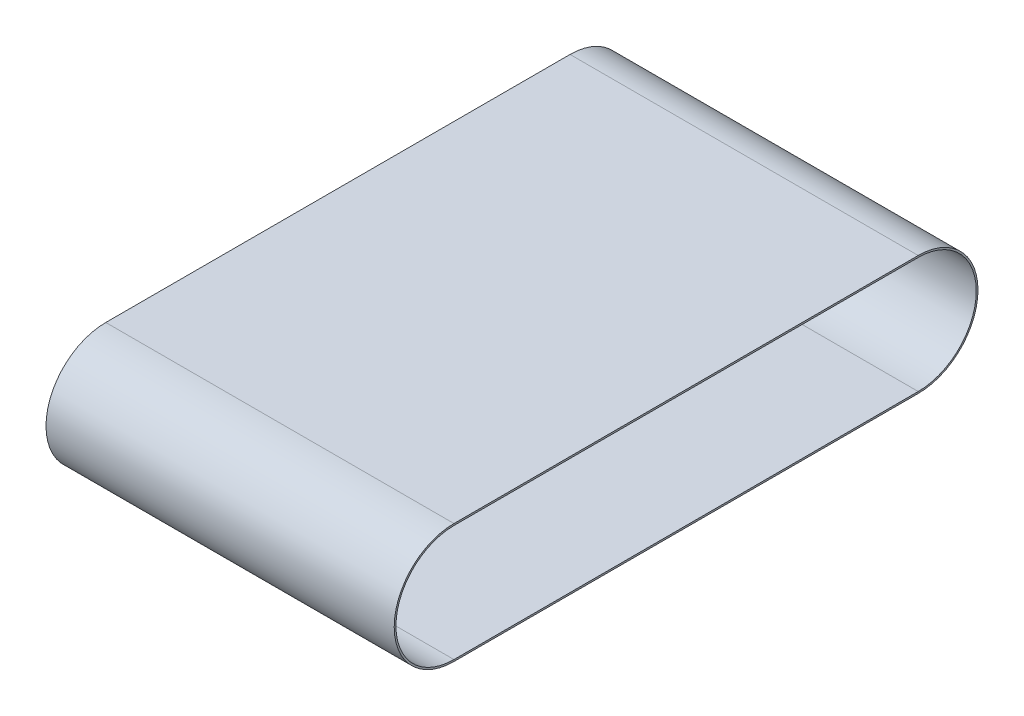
ISO-10303-21;
HEADER;
FILE_DESCRIPTION(('STEP AP214'),'2;1');
FILE_NAME('part.step','',(''),(''),'','','');
FILE_SCHEMA(('AUTOMOTIVE_DESIGN { 1 0 10303 214 1 1 1 1 }'));
ENDSEC;
DATA;
#1=APPLICATION_CONTEXT('core data for automotive mechanical design processes');
#2=APPLICATION_PROTOCOL_DEFINITION('international standard','automotive_design',2000,#1);
#3=PRODUCT_CONTEXT('',#1,'mechanical');
#4=PRODUCT('Part','Part','',(#3));
#5=PRODUCT_RELATED_PRODUCT_CATEGORY('part','',(#4));
#6=PRODUCT_DEFINITION_FORMATION('','',#4);
#7=PRODUCT_DEFINITION_CONTEXT('part definition',#1,'design');
#8=PRODUCT_DEFINITION('design','',#6,#7);
#9=PRODUCT_DEFINITION_SHAPE('','',#8);
#10=(LENGTH_UNIT() NAMED_UNIT(*) SI_UNIT(.MILLI.,.METRE.));
#11=(NAMED_UNIT(*) PLANE_ANGLE_UNIT() SI_UNIT($,.RADIAN.));
#12=(NAMED_UNIT(*) SI_UNIT($,.STERADIAN.) SOLID_ANGLE_UNIT());
#13=UNCERTAINTY_MEASURE_WITH_UNIT(LENGTH_MEASURE(1.E-05),#10,'distance_accuracy_value','');
#14=(GEOMETRIC_REPRESENTATION_CONTEXT(3) GLOBAL_UNCERTAINTY_ASSIGNED_CONTEXT((#13)) GLOBAL_UNIT_ASSIGNED_CONTEXT((#10,
#11,#12)) REPRESENTATION_CONTEXT('',''));
#15=CARTESIAN_POINT('',(0.,0.,0.));
#16=DIRECTION('',(0.,0.,1.));
#17=DIRECTION('',(1.,0.,0.));
#18=AXIS2_PLACEMENT_3D('',#15,#16,#17);
#19=CARTESIAN_POINT('',(300.,0.,0.));
#20=DIRECTION('',(1.,0.,0.));
#21=DIRECTION('',(0.,0.,-1.));
#22=AXIS2_PLACEMENT_3D('',#19,#20,#21);
#23=PLANE('',#22);
#24=CARTESIAN_POINT('',(300.,0.,0.));
#25=DIRECTION('',(1.,0.,0.));
#26=DIRECTION('',(0.,0.,-1.));
#27=AXIS2_PLACEMENT_3D('',#24,#25,#26);
#28=CIRCLE('',#27,103.);
#29=CARTESIAN_POINT('',(300.,103.,0.));
#30=VERTEX_POINT('',#29);
#31=CARTESIAN_POINT('',(300.,-103.,0.));
#32=VERTEX_POINT('',#31);
#33=EDGE_CURVE('E139',#30,#32,#28,.T.);
#34=ORIENTED_EDGE('',*,*,#33,.T.);
#35=DIRECTION('',(0.,0.,-1.));
#36=VECTOR('',#35,1.);
#37=CARTESIAN_POINT('',(300.,-103.,0.));
#38=LINE('',#37,#36);
#39=CARTESIAN_POINT('',(300.,-103.,-800.));
#40=VERTEX_POINT('',#39);
#41=EDGE_CURVE('E142',#32,#40,#38,.T.);
#42=ORIENTED_EDGE('',*,*,#41,.T.);
#43=CARTESIAN_POINT('',(300.,0.,-800.));
#44=DIRECTION('',(1.,0.,0.));
#45=DIRECTION('',(0.,0.,-1.));
#46=AXIS2_PLACEMENT_3D('',#43,#44,#45);
#47=CIRCLE('',#46,103.);
#48=CARTESIAN_POINT('',(300.,103.,-800.));
#49=VERTEX_POINT('',#48);
#50=EDGE_CURVE('E145',#40,#49,#47,.T.);
#51=ORIENTED_EDGE('',*,*,#50,.T.);
#52=DIRECTION('',(0.,0.,1.));
#53=VECTOR('',#52,1.);
#54=CARTESIAN_POINT('',(300.,103.,0.));
#55=LINE('',#54,#53);
#56=EDGE_CURVE('E147',#49,#30,#55,.T.);
#57=ORIENTED_EDGE('',*,*,#56,.T.);
#58=EDGE_LOOP('',(#34,#42,#51,#57));
#59=FACE_BOUND('',#58,.T.);
#60=DIRECTION('',(0.,0.,-1.));
#61=VECTOR('',#60,1.);
#62=CARTESIAN_POINT('',(300.,-100.,0.));
#63=LINE('',#62,#61);
#64=CARTESIAN_POINT('',(300.,-100.,0.));
#65=VERTEX_POINT('',#64);
#66=CARTESIAN_POINT('',(300.,-100.,-800.));
#67=VERTEX_POINT('',#66);
#68=EDGE_CURVE('E111',#65,#67,#63,.T.);
#69=ORIENTED_EDGE('',*,*,#68,.F.);
#70=CARTESIAN_POINT('',(300.,0.,0.));
#71=DIRECTION('',(1.,0.,0.));
#72=DIRECTION('',(0.,0.,-1.));
#73=AXIS2_PLACEMENT_3D('',#70,#71,#72);
#74=CIRCLE('',#73,100.);
#75=CARTESIAN_POINT('',(300.,100.,0.));
#76=VERTEX_POINT('',#75);
#77=EDGE_CURVE('E103',#76,#65,#74,.T.);
#78=ORIENTED_EDGE('',*,*,#77,.F.);
#79=DIRECTION('',(0.,0.,1.));
#80=VECTOR('',#79,1.);
#81=CARTESIAN_POINT('',(300.,100.,0.));
#82=LINE('',#81,#80);
#83=CARTESIAN_POINT('',(300.,100.,-800.));
#84=VERTEX_POINT('',#83);
#85=EDGE_CURVE('E125',#84,#76,#82,.T.);
#86=ORIENTED_EDGE('',*,*,#85,.F.);
#87=CARTESIAN_POINT('',(300.,0.,-800.));
#88=DIRECTION('',(1.,0.,0.));
#89=DIRECTION('',(0.,0.,-1.));
#90=AXIS2_PLACEMENT_3D('',#87,#88,#89);
#91=CIRCLE('',#90,100.);
#92=EDGE_CURVE('E123',#67,#84,#91,.T.);
#93=ORIENTED_EDGE('',*,*,#92,.F.);
#94=EDGE_LOOP('',(#69,#78,#86,#93));
#95=FACE_BOUND('',#94,.T.);
#96=ADVANCED_FACE('F38',(#59,#95),#23,.T.);
#97=CARTESIAN_POINT('',(-300.,0.,0.));
#98=DIRECTION('',(1.,0.,0.));
#99=DIRECTION('',(0.,0.,-1.));
#100=AXIS2_PLACEMENT_3D('',#97,#98,#99);
#101=PLANE('',#100);
#102=CARTESIAN_POINT('',(-300.,0.,0.));
#103=DIRECTION('',(1.,0.,0.));
#104=DIRECTION('',(0.,0.,-1.));
#105=AXIS2_PLACEMENT_3D('',#102,#103,#104);
#106=CIRCLE('',#105,103.);
#107=CARTESIAN_POINT('',(-300.,103.,0.));
#108=VERTEX_POINT('',#107);
#109=CARTESIAN_POINT('',(-300.,-103.,0.));
#110=VERTEX_POINT('',#109);
#111=EDGE_CURVE('E119',#108,#110,#106,.T.);
#112=ORIENTED_EDGE('',*,*,#111,.F.);
#113=DIRECTION('',(0.,0.,1.));
#114=VECTOR('',#113,1.);
#115=CARTESIAN_POINT('',(-300.,103.,0.));
#116=LINE('',#115,#114);
#117=CARTESIAN_POINT('',(-300.,103.,-800.));
#118=VERTEX_POINT('',#117);
#119=EDGE_CURVE('E143',#118,#108,#116,.T.);
#120=ORIENTED_EDGE('',*,*,#119,.F.);
#121=CARTESIAN_POINT('',(-300.,0.,-800.));
#122=DIRECTION('',(1.,0.,0.));
#123=DIRECTION('',(0.,0.,-1.));
#124=AXIS2_PLACEMENT_3D('',#121,#122,#123);
#125=CIRCLE('',#124,103.);
#126=CARTESIAN_POINT('',(-300.,-103.,-800.));
#127=VERTEX_POINT('',#126);
#128=EDGE_CURVE('E154',#127,#118,#125,.T.);
#129=ORIENTED_EDGE('',*,*,#128,.F.);
#130=DIRECTION('',(0.,0.,-1.));
#131=VECTOR('',#130,1.);
#132=CARTESIAN_POINT('',(-300.,-103.,0.));
#133=LINE('',#132,#131);
#134=EDGE_CURVE('E152',#110,#127,#133,.T.);
#135=ORIENTED_EDGE('',*,*,#134,.F.);
#136=EDGE_LOOP('',(#112,#120,#129,#135));
#137=FACE_BOUND('',#136,.T.);
#138=CARTESIAN_POINT('',(-300.,0.,0.));
#139=DIRECTION('',(1.,0.,0.));
#140=DIRECTION('',(0.,0.,-1.));
#141=AXIS2_PLACEMENT_3D('',#138,#139,#140);
#142=CIRCLE('',#141,100.);
#143=CARTESIAN_POINT('',(-300.,100.,0.));
#144=VERTEX_POINT('',#143);
#145=CARTESIAN_POINT('',(-300.,-100.,0.));
#146=VERTEX_POINT('',#145);
#147=EDGE_CURVE('E61',#144,#146,#142,.T.);
#148=ORIENTED_EDGE('',*,*,#147,.T.);
#149=DIRECTION('',(0.,0.,-1.));
#150=VECTOR('',#149,1.);
#151=CARTESIAN_POINT('',(-300.,-100.,0.));
#152=LINE('',#151,#150);
#153=CARTESIAN_POINT('',(-300.,-100.,-800.));
#154=VERTEX_POINT('',#153);
#155=EDGE_CURVE('E118',#146,#154,#152,.T.);
#156=ORIENTED_EDGE('',*,*,#155,.T.);
#157=CARTESIAN_POINT('',(-300.,0.,-800.));
#158=DIRECTION('',(1.,0.,0.));
#159=DIRECTION('',(0.,0.,-1.));
#160=AXIS2_PLACEMENT_3D('',#157,#158,#159);
#161=CIRCLE('',#160,100.);
#162=CARTESIAN_POINT('',(-300.,100.,-800.));
#163=VERTEX_POINT('',#162);
#164=EDGE_CURVE('E131',#154,#163,#161,.T.);
#165=ORIENTED_EDGE('',*,*,#164,.T.);
#166=DIRECTION('',(0.,0.,1.));
#167=VECTOR('',#166,1.);
#168=CARTESIAN_POINT('',(-300.,100.,0.));
#169=LINE('',#168,#167);
#170=EDGE_CURVE('E112',#163,#144,#169,.T.);
#171=ORIENTED_EDGE('',*,*,#170,.T.);
#172=EDGE_LOOP('',(#148,#156,#165,#171));
#173=FACE_BOUND('',#172,.T.);
#174=ADVANCED_FACE('F172',(#137,#173),#101,.F.);
#175=CARTESIAN_POINT('',(300.,0.,0.));
#176=DIRECTION('',(-1.,0.,0.));
#177=DIRECTION('',(0.,0.,1.));
#178=AXIS2_PLACEMENT_3D('',#175,#176,#177);
#179=CYLINDRICAL_SURFACE('',#178,103.);
#180=ORIENTED_EDGE('',*,*,#111,.T.);
#181=DIRECTION('',(-1.,0.,0.));
#182=VECTOR('',#181,1.);
#183=CARTESIAN_POINT('',(300.,-103.,0.));
#184=LINE('',#183,#182);
#185=EDGE_CURVE('E11',#32,#110,#184,.T.);
#186=ORIENTED_EDGE('',*,*,#185,.F.);
#187=ORIENTED_EDGE('',*,*,#33,.F.);
#188=DIRECTION('',(-1.,0.,0.));
#189=VECTOR('',#188,1.);
#190=CARTESIAN_POINT('',(300.,103.,0.));
#191=LINE('',#190,#189);
#192=EDGE_CURVE('E149',#30,#108,#191,.T.);
#193=ORIENTED_EDGE('',*,*,#192,.T.);
#194=EDGE_LOOP('',(#180,#186,#187,#193));
#195=FACE_BOUND('',#194,.T.);
#196=ADVANCED_FACE('F40',(#195),#179,.T.);
#197=CARTESIAN_POINT('',(300.,-103.,0.));
#198=DIRECTION('',(0.,1.,0.));
#199=DIRECTION('',(0.,0.,1.));
#200=AXIS2_PLACEMENT_3D('',#197,#198,#199);
#201=PLANE('',#200);
#202=ORIENTED_EDGE('',*,*,#134,.T.);
#203=DIRECTION('',(-1.,0.,0.));
#204=VECTOR('',#203,1.);
#205=CARTESIAN_POINT('',(300.,-103.,-800.));
#206=LINE('',#205,#204);
#207=EDGE_CURVE('E46',#40,#127,#206,.T.);
#208=ORIENTED_EDGE('',*,*,#207,.F.);
#209=ORIENTED_EDGE('',*,*,#41,.F.);
#210=ORIENTED_EDGE('',*,*,#185,.T.);
#211=EDGE_LOOP('',(#202,#208,#209,#210));
#212=FACE_BOUND('',#211,.T.);
#213=ADVANCED_FACE('F182',(#212),#201,.F.);
#214=CARTESIAN_POINT('',(300.,0.,-800.));
#215=DIRECTION('',(-1.,0.,0.));
#216=DIRECTION('',(0.,0.,1.));
#217=AXIS2_PLACEMENT_3D('',#214,#215,#216);
#218=CYLINDRICAL_SURFACE('',#217,103.);
#219=ORIENTED_EDGE('',*,*,#128,.T.);
#220=DIRECTION('',(-1.,0.,0.));
#221=VECTOR('',#220,1.);
#222=CARTESIAN_POINT('',(300.,103.,-800.));
#223=LINE('',#222,#221);
#224=EDGE_CURVE('E159',#49,#118,#223,.T.);
#225=ORIENTED_EDGE('',*,*,#224,.F.);
#226=ORIENTED_EDGE('',*,*,#50,.F.);
#227=ORIENTED_EDGE('',*,*,#207,.T.);
#228=EDGE_LOOP('',(#219,#225,#226,#227));
#229=FACE_BOUND('',#228,.T.);
#230=ADVANCED_FACE('F166',(#229),#218,.T.);
#231=CARTESIAN_POINT('',(300.,103.,0.));
#232=DIRECTION('',(0.,-1.,0.));
#233=DIRECTION('',(0.,0.,-1.));
#234=AXIS2_PLACEMENT_3D('',#231,#232,#233);
#235=PLANE('',#234);
#236=ORIENTED_EDGE('',*,*,#119,.T.);
#237=ORIENTED_EDGE('',*,*,#192,.F.);
#238=ORIENTED_EDGE('',*,*,#56,.F.);
#239=ORIENTED_EDGE('',*,*,#224,.T.);
#240=EDGE_LOOP('',(#236,#237,#238,#239));
#241=FACE_BOUND('',#240,.T.);
#242=ADVANCED_FACE('F176',(#241),#235,.F.);
#243=CARTESIAN_POINT('',(300.,0.,0.));
#244=DIRECTION('',(-1.,0.,0.));
#245=DIRECTION('',(0.,0.,1.));
#246=AXIS2_PLACEMENT_3D('',#243,#244,#245);
#247=CYLINDRICAL_SURFACE('',#246,100.);
#248=ORIENTED_EDGE('',*,*,#147,.F.);
#249=DIRECTION('',(-1.,0.,0.));
#250=VECTOR('',#249,1.);
#251=CARTESIAN_POINT('',(300.,100.,0.));
#252=LINE('',#251,#250);
#253=EDGE_CURVE('E107',#76,#144,#252,.T.);
#254=ORIENTED_EDGE('',*,*,#253,.F.);
#255=ORIENTED_EDGE('',*,*,#77,.T.);
#256=DIRECTION('',(-1.,0.,0.));
#257=VECTOR('',#256,1.);
#258=CARTESIAN_POINT('',(300.,-100.,0.));
#259=LINE('',#258,#257);
#260=EDGE_CURVE('E106',#65,#146,#259,.T.);
#261=ORIENTED_EDGE('',*,*,#260,.T.);
#262=EDGE_LOOP('',(#248,#254,#255,#261));
#263=FACE_BOUND('',#262,.T.);
#264=ADVANCED_FACE('F105',(#263),#247,.F.);
#265=CARTESIAN_POINT('',(300.,-100.,0.));
#266=DIRECTION('',(0.,1.,0.));
#267=DIRECTION('',(0.,0.,1.));
#268=AXIS2_PLACEMENT_3D('',#265,#266,#267);
#269=PLANE('',#268);
#270=ORIENTED_EDGE('',*,*,#155,.F.);
#271=ORIENTED_EDGE('',*,*,#260,.F.);
#272=ORIENTED_EDGE('',*,*,#68,.T.);
#273=DIRECTION('',(-1.,0.,0.));
#274=VECTOR('',#273,1.);
#275=CARTESIAN_POINT('',(300.,-100.,-800.));
#276=LINE('',#275,#274);
#277=EDGE_CURVE('E120',#67,#154,#276,.T.);
#278=ORIENTED_EDGE('',*,*,#277,.T.);
#279=EDGE_LOOP('',(#270,#271,#272,#278));
#280=FACE_BOUND('',#279,.T.);
#281=ADVANCED_FACE('F115',(#280),#269,.T.);
#282=CARTESIAN_POINT('',(300.,0.,-800.));
#283=DIRECTION('',(-1.,0.,0.));
#284=DIRECTION('',(0.,0.,1.));
#285=AXIS2_PLACEMENT_3D('',#282,#283,#284);
#286=CYLINDRICAL_SURFACE('',#285,100.);
#287=ORIENTED_EDGE('',*,*,#164,.F.);
#288=ORIENTED_EDGE('',*,*,#277,.F.);
#289=ORIENTED_EDGE('',*,*,#92,.T.);
#290=DIRECTION('',(-1.,0.,0.));
#291=VECTOR('',#290,1.);
#292=CARTESIAN_POINT('',(300.,100.,-800.));
#293=LINE('',#292,#291);
#294=EDGE_CURVE('E53',#84,#163,#293,.T.);
#295=ORIENTED_EDGE('',*,*,#294,.T.);
#296=EDGE_LOOP('',(#287,#288,#289,#295));
#297=FACE_BOUND('',#296,.T.);
#298=ADVANCED_FACE('F205',(#297),#286,.F.);
#299=CARTESIAN_POINT('',(300.,100.,0.));
#300=DIRECTION('',(0.,-1.,0.));
#301=DIRECTION('',(0.,0.,-1.));
#302=AXIS2_PLACEMENT_3D('',#299,#300,#301);
#303=PLANE('',#302);
#304=ORIENTED_EDGE('',*,*,#170,.F.);
#305=ORIENTED_EDGE('',*,*,#294,.F.);
#306=ORIENTED_EDGE('',*,*,#85,.T.);
#307=ORIENTED_EDGE('',*,*,#253,.T.);
#308=EDGE_LOOP('',(#304,#305,#306,#307));
#309=FACE_BOUND('',#308,.T.);
#310=ADVANCED_FACE('F209',(#309),#303,.T.);
#311=CLOSED_SHELL('',(#96,#174,#196,#213,#230,#242,#264,#281,#298,#310));
#312=MANIFOLD_SOLID_BREP('B2',#311);
#313=ADVANCED_BREP_SHAPE_REPRESENTATION('',(#18,#312),#14);
#314=SHAPE_DEFINITION_REPRESENTATION(#9,#313);
ENDSEC;
END-ISO-10303-21;
